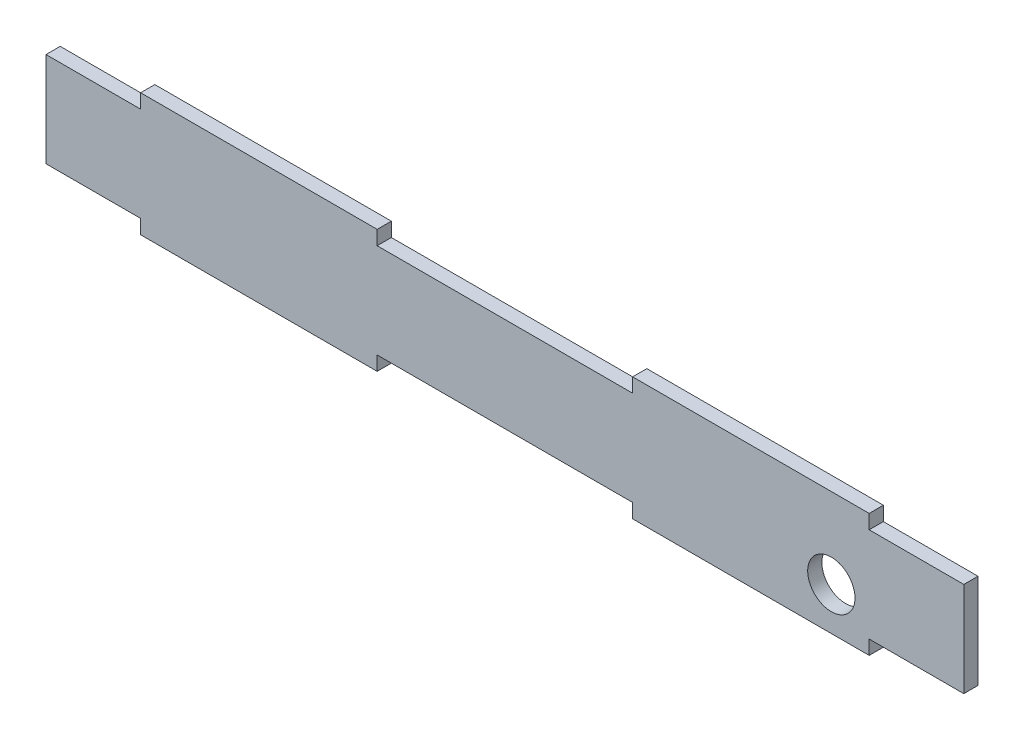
from build123d import *

# Parameters (mm, degrees)
SKETCH1_R           = 5
BOSS_EXTRUDE1_DEPTH = 3


with BuildPart() as part:
    # Sketch1 → Boss-Extrude1 (new body)
    with BuildSketch(Plane.XY):
        Polygon((0, 20), (0, 0), (20, 0), (20, -3), (70, -3), (70, 0), (124, 0), (124, -3), (174, -3), (174, 0), (194, 0), (194, 20), (174, 20), (174, 23), (124, 23), (124, 20), (70, 20), (70, 23), (20, 23), (20, 20), align=None)
        with Locations((166, 6)):
            Circle(SKETCH1_R, mode=Mode.SUBTRACT)
    extrude(amount=BOSS_EXTRUDE1_DEPTH)


solid = part.part
